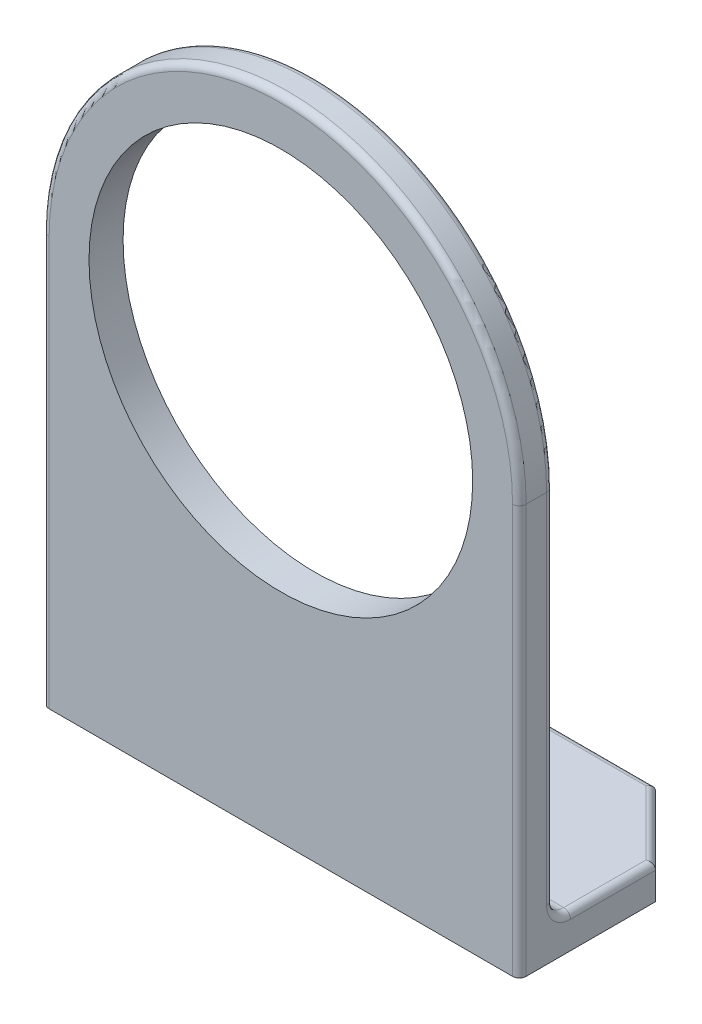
from build123d import *

# Parameters (mm, degrees)
SKETCH1_R          = 35.75
EXTRUDE2_DEPTH     = 6.35
SKETCH3_W          = 88.9
SKETCH3_H          = 6.35
EXTRUDE3_DEPTH     = 31.75
CHAMFER1_SIZE      = 12.7
CHAMFER2_SIZE      = 12.7
FILLET2_R          = 3.175
SKETCH4_R          = 3.2512
CUT_EXTRUDE1_DEPTH = 127.68210213
FILLET3_R          = 1.27


with BuildPart() as part:
    # Sketch1 → Extrude2 (new body)
    with BuildSketch(Plane.XY):
        with BuildLine():
            Line((-44.45, 0), (-44.45, -76.2))
            Line((-44.45, -76.2), (44.45, -76.2))
            Line((44.45, -76.2), (44.45, 0))
            ThreePointArc((44.45, 0), (0, 44.45), (-44.45, 0))
        make_face()
        with Locations(Location((0, 0, 0), (0, 0, 180))):
            Circle(SKETCH1_R, mode=Mode.SUBTRACT)
    extrude(amount=EXTRUDE2_DEPTH)

    # Sketch3 → Extrude3 (add)
    with BuildSketch(Plane(origin=(0, 0, 0), x_dir=(-1, 0, 0), z_dir=(0, 0, -1))):
        with Locations((0, -73.025)):
            Rectangle(SKETCH3_W, SKETCH3_H)
    extrude(amount=EXTRUDE3_DEPTH)

    # Chamfer1
    chamfer1_edges = [part.edges().sort_by_distance(p)[0] for p in [
        (44.45, -73.025, -31.75),
    ]]
    chamfer(chamfer1_edges, length=CHAMFER1_SIZE)

    # Chamfer2
    chamfer2_edges = [part.edges().sort_by_distance(p)[0] for p in [
        (-44.45, -73.025, -31.75),
    ]]
    chamfer(chamfer2_edges, length=CHAMFER2_SIZE)

    # Fillet2
    fillet2_edges = [part.edges().sort_by_distance(p)[0] for p in [
        (0, -69.85, 0),
    ]]
    fillet(fillet2_edges, radius=FILLET2_R)

    # Sketch4 → Cut-Extrude1 (cut, through all)
    with BuildSketch(Plane(origin=(0, -69.85, 0), x_dir=(1, 0, 0), z_dir=(0, 1, 0))):
        with Locations(Location((0, 23.815172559, 0), (0, 0, 270))):
            Circle(SKETCH4_R)
        with Locations(Location((22.225, 9.527672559, 0), (0, 0, 270))):
            Circle(SKETCH4_R)
        with Locations(Location((-22.225, 9.527672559, 0), (0, 0, 90))):
            Circle(SKETCH4_R)
    extrude(amount=-CUT_EXTRUDE1_DEPTH, mode=Mode.SUBTRACT)

    # Fillet3
    fillet3_edges = [part.edges().sort_by_distance(p)[0] for p in [
        (44.45, -38.1, 6.35),
        (0, 44.45, 6.35),
        (-44.45, -38.1, 6.35),
        (44.45, -69.85, -11.1125),
        (38.1, -69.85, -25.4),
        (0, -69.85, -31.75),
        (-44.45, -69.85, -11.1125),
        (-38.1, -69.85, -25.4),
        (-44.45, -33.3375, 0),
        (44.45, -33.3375, 0),
        (44.45, -68.92006403, -0.92993597),
        (-44.45, -68.92006403, -0.92993597),
        (0, 44.45, 0),
    ]]
    fillet(fillet3_edges, radius=FILLET3_R)


solid = part.part
